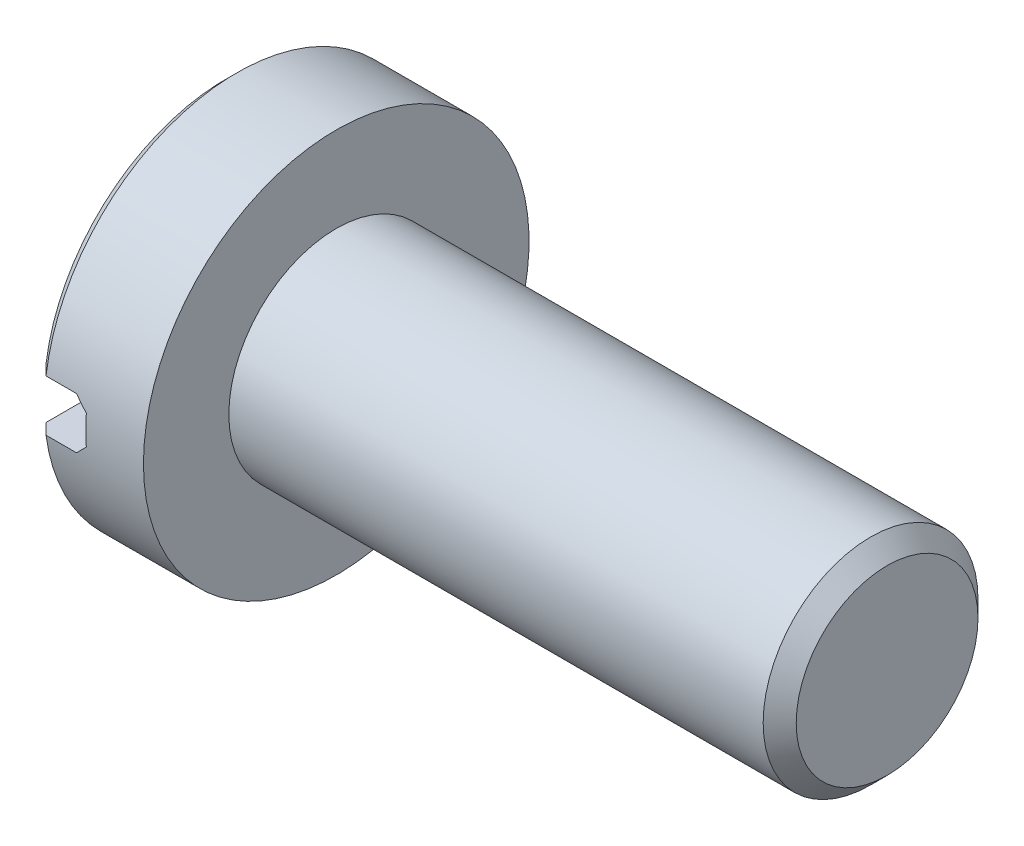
ISO-10303-21;
HEADER;
FILE_DESCRIPTION(('STEP AP214'),'2;1');
FILE_NAME('part.step','',(''),(''),'','','');
FILE_SCHEMA(('AUTOMOTIVE_DESIGN { 1 0 10303 214 1 1 1 1 }'));
ENDSEC;
DATA;
#1=APPLICATION_CONTEXT('core data for automotive mechanical design processes');
#2=APPLICATION_PROTOCOL_DEFINITION('international standard','automotive_design',2000,#1);
#3=PRODUCT_CONTEXT('',#1,'mechanical');
#4=PRODUCT('Part','Part','',(#3));
#5=PRODUCT_RELATED_PRODUCT_CATEGORY('part','',(#4));
#6=PRODUCT_DEFINITION_FORMATION('','',#4);
#7=PRODUCT_DEFINITION_CONTEXT('part definition',#1,'design');
#8=PRODUCT_DEFINITION('design','',#6,#7);
#9=PRODUCT_DEFINITION_SHAPE('','',#8);
#10=(LENGTH_UNIT() NAMED_UNIT(*) SI_UNIT(.MILLI.,.METRE.));
#11=(NAMED_UNIT(*) PLANE_ANGLE_UNIT() SI_UNIT($,.RADIAN.));
#12=(NAMED_UNIT(*) SI_UNIT($,.STERADIAN.) SOLID_ANGLE_UNIT());
#13=UNCERTAINTY_MEASURE_WITH_UNIT(LENGTH_MEASURE(1.E-05),#10,'distance_accuracy_value','');
#14=(GEOMETRIC_REPRESENTATION_CONTEXT(3) GLOBAL_UNCERTAINTY_ASSIGNED_CONTEXT((#13)) GLOBAL_UNIT_ASSIGNED_CONTEXT((#10,
#11,#12)) REPRESENTATION_CONTEXT('',''));
#15=CARTESIAN_POINT('',(0.,0.,0.));
#16=DIRECTION('',(0.,0.,1.));
#17=DIRECTION('',(1.,0.,0.));
#18=AXIS2_PLACEMENT_3D('',#15,#16,#17);
#19=CARTESIAN_POINT('',(0.,0.,0.));
#20=DIRECTION('',(1.,0.,0.));
#21=DIRECTION('',(0.,0.,-1.));
#22=AXIS2_PLACEMENT_3D('',#19,#20,#21);
#23=PLANE('',#22);
#24=CARTESIAN_POINT('',(0.,0.,0.));
#25=DIRECTION('',(-1.,0.,0.));
#26=DIRECTION('',(0.,0.,1.));
#27=AXIS2_PLACEMENT_3D('',#24,#25,#26);
#28=CIRCLE('',#27,3.3);
#29=CARTESIAN_POINT('',(0.,0.465549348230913,3.26699614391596));
#30=VERTEX_POINT('',#29);
#31=CARTESIAN_POINT('',(0.,0.465549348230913,-3.26699614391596));
#32=VERTEX_POINT('',#31);
#33=EDGE_CURVE('E116',#30,#32,#28,.T.);
#34=ORIENTED_EDGE('',*,*,#33,.T.);
#35=DIRECTION('',(0.,0.,1.));
#36=VECTOR('',#35,1.);
#37=CARTESIAN_POINT('',(0.,0.465549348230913,-5.));
#38=LINE('',#37,#36);
#39=EDGE_CURVE('E108',#32,#30,#38,.T.);
#40=ORIENTED_EDGE('',*,*,#39,.T.);
#41=EDGE_LOOP('',(#34,#40));
#42=FACE_BOUND('',#41,.T.);
#43=ADVANCED_FACE('F33',(#42),#23,.F.);
#44=CARTESIAN_POINT('',(0.2,0.,0.));
#45=DIRECTION('',(1.,0.,0.));
#46=DIRECTION('',(0.,0.,-1.));
#47=AXIS2_PLACEMENT_3D('',#44,#45,#46);
#48=CONICAL_SURFACE('',#47,3.5,0.785398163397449);
#49=CARTESIAN_POINT('',(0.2,0.,0.));
#50=DIRECTION('',(-1.,0.,0.));
#51=DIRECTION('',(0.,0.,1.));
#52=AXIS2_PLACEMENT_3D('',#49,#50,#51);
#53=CIRCLE('',#52,3.5);
#54=CARTESIAN_POINT('',(0.2,0.465549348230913,3.46889950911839));
#55=VERTEX_POINT('',#54);
#56=CARTESIAN_POINT('',(0.2,0.465549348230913,-3.46889950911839));
#57=VERTEX_POINT('',#56);
#58=EDGE_CURVE('E117',#55,#57,#53,.T.);
#59=ORIENTED_EDGE('',*,*,#58,.T.);
#60=CARTESIAN_POINT('',(4.40191393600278,0.465549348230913,-7.68783077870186));
#61=CARTESIAN_POINT('',(4.14003731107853,0.465549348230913,-7.42547061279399));
#62=CARTESIAN_POINT('',(3.87818163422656,0.465549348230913,-7.16308952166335));
#63=CARTESIAN_POINT('',(3.35453517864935,0.465549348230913,-6.63825496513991));
#64=CARTESIAN_POINT('',(3.09274440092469,0.465549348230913,-6.37580149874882));
#65=CARTESIAN_POINT('',(2.56917324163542,0.465549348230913,-5.85071392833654));
#66=CARTESIAN_POINT('',(2.30739289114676,0.465549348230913,-5.58807979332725));
#67=CARTESIAN_POINT('',(1.78397993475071,0.465549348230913,-5.0626717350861));
#68=CARTESIAN_POINT('',(1.52234732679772,0.465549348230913,-4.79989781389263));
#69=CARTESIAN_POINT('',(0.99195532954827,0.465549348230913,-4.26672055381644));
#70=CARTESIAN_POINT('',(0.723202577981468,0.465549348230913,-3.99631061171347));
#71=CARTESIAN_POINT('',(0.186112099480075,0.465549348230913,-3.45505585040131));
#72=CARTESIAN_POINT('',(-0.0822256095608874,0.465549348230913,-3.18421101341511));
#73=CARTESIAN_POINT('',(-0.484027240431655,0.465549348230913,-2.77730282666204));
#74=CARTESIAN_POINT('',(-0.617829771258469,0.465549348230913,-2.64157406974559));
#75=CARTESIAN_POINT('',(-0.885074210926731,0.465549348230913,-2.36975739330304));
#76=CARTESIAN_POINT('',(-1.01851611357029,0.465549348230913,-2.23366946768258));
#77=CARTESIAN_POINT('',(-1.28479456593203,0.465549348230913,-1.96092161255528));
#78=CARTESIAN_POINT('',(-1.41763116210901,0.465549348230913,-1.82426172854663));
#79=CARTESIAN_POINT('',(-1.61602415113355,0.465549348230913,-1.61844416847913));
#80=CARTESIAN_POINT('',(-1.68201058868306,0.465549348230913,-1.54970131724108));
#81=CARTESIAN_POINT('',(-1.81355800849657,0.465549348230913,-1.41181004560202));
#82=CARTESIAN_POINT('',(-1.87911899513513,0.465549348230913,-1.34266162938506));
#83=CARTESIAN_POINT('',(-1.97951973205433,0.465549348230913,-1.23575684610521));
#84=CARTESIAN_POINT('',(-2.01459292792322,0.465549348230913,-1.19821983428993));
#85=CARTESIAN_POINT('',(-2.08448824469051,0.465549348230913,-1.12291139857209));
#86=CARTESIAN_POINT('',(-2.11931036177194,0.465549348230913,-1.08513997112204));
#87=CARTESIAN_POINT('',(-2.18853408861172,0.465549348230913,-1.00938438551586));
#88=CARTESIAN_POINT('',(-2.22293652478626,0.465549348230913,-0.971400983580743));
#89=CARTESIAN_POINT('',(-2.2912817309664,0.465549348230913,-0.895023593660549));
#90=CARTESIAN_POINT('',(-2.32522451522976,0.465549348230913,-0.856629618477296));
#91=CARTESIAN_POINT('',(-2.40171511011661,0.465549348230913,-0.768621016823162));
#92=CARTESIAN_POINT('',(-2.44405832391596,0.465549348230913,-0.718828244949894));
#93=CARTESIAN_POINT('',(-2.52717632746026,0.465549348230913,-0.61755940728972));
#94=CARTESIAN_POINT('',(-2.56794360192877,0.465549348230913,-0.566077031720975));
#95=CARTESIAN_POINT('',(-2.6267348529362,0.465549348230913,-0.486684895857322));
#96=CARTESIAN_POINT('',(-2.64602757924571,0.465549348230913,-0.459721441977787));
#97=CARTESIAN_POINT('',(-2.68334610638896,0.465549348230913,-0.404886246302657));
#98=CARTESIAN_POINT('',(-2.70137077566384,0.465549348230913,-0.377013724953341));
#99=CARTESIAN_POINT('',(-2.73539460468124,0.465549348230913,-0.320245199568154));
#100=CARTESIAN_POINT('',(-2.75140438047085,0.465549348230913,-0.291355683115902));
#101=CARTESIAN_POINT('',(-2.78042556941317,0.465549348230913,-0.232134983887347));
#102=CARTESIAN_POINT('',(-2.79344313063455,0.465549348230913,-0.201806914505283));
#103=CARTESIAN_POINT('',(-2.81487197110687,0.465549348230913,-0.139505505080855));
#104=CARTESIAN_POINT('',(-2.82328789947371,0.465549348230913,-0.107533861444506));
#105=CARTESIAN_POINT('',(-2.83357686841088,0.465549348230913,-0.0426642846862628));
#106=CARTESIAN_POINT('',(-2.83548877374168,0.465549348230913,-0.00977304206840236));
#107=CARTESIAN_POINT('',(-2.8322830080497,0.465549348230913,0.0556497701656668));
#108=CARTESIAN_POINT('',(-2.82716197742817,0.465549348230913,0.0881811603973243));
#109=CARTESIAN_POINT('',(-2.81127176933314,0.465549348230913,0.151954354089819));
#110=CARTESIAN_POINT('',(-2.80046518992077,0.465549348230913,0.183186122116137));
#111=CARTESIAN_POINT('',(-2.77169158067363,0.465549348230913,0.252216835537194));
#112=CARTESIAN_POINT('',(-2.75257974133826,0.465549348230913,0.28951762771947));
#113=CARTESIAN_POINT('',(-2.71091087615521,0.465549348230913,0.362179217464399));
#114=CARTESIAN_POINT('',(-2.68834490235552,0.465549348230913,0.397534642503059));
#115=CARTESIAN_POINT('',(-2.64101528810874,0.465549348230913,0.467092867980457));
#116=CARTESIAN_POINT('',(-2.61623709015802,0.465549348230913,0.501285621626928));
#117=CARTESIAN_POINT('',(-2.56542394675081,0.465549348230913,0.56863990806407));
#118=CARTESIAN_POINT('',(-2.53939072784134,0.465549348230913,0.601802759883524));
#119=CARTESIAN_POINT('',(-2.48216715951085,0.465549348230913,0.672773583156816));
#120=CARTESIAN_POINT('',(-2.45082666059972,0.465549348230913,0.710459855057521));
#121=CARTESIAN_POINT('',(-2.38738327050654,0.465549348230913,0.785186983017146));
#122=CARTESIAN_POINT('',(-2.35528030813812,0.465549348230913,0.822227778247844));
#123=CARTESIAN_POINT('',(-2.25817706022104,0.465549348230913,0.932688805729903));
#124=CARTESIAN_POINT('',(-2.19240103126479,0.465549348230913,1.00542526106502));
#125=CARTESIAN_POINT('',(-2.05967494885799,0.465549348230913,1.14998708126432));
#126=CARTESIAN_POINT('',(-1.99272345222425,0.465549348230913,1.22181110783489));
#127=CARTESIAN_POINT('',(-1.8581670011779,0.465549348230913,1.36481961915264));
#128=CARTESIAN_POINT('',(-1.79056216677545,0.465549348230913,1.43600421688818));
#129=CARTESIAN_POINT('',(-1.65536323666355,0.465549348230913,1.57750566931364));
#130=CARTESIAN_POINT('',(-1.58777189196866,0.465549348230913,1.64782515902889));
#131=CARTESIAN_POINT('',(-1.45229526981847,0.465549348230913,1.78818663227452));
#132=CARTESIAN_POINT('',(-1.38440997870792,0.465549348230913,1.85822860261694));
#133=CARTESIAN_POINT('',(-1.18054210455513,0.465549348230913,2.06795858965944));
#134=CARTESIAN_POINT('',(-1.04425331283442,0.465549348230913,2.20734874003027));
#135=CARTESIAN_POINT('',(-0.689169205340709,0.465549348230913,2.56935506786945));
#136=CARTESIAN_POINT('',(-0.470026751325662,0.465549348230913,2.79163016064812));
#137=CARTESIAN_POINT('',(-0.0312004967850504,0.465549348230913,3.23564818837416));
#138=CARTESIAN_POINT('',(0.18848330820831,0.465549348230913,3.45739111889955));
#139=CARTESIAN_POINT('',(0.628225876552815,0.465549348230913,3.90064057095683));
#140=CARTESIAN_POINT('',(0.848284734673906,0.465549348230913,4.12214699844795));
#141=CARTESIAN_POINT('',(1.2885900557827,0.465549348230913,4.56497199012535));
#142=CARTESIAN_POINT('',(1.50883651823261,0.465549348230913,4.78629055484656));
#143=CARTESIAN_POINT('',(2.17434181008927,0.465549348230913,5.45467038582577));
#144=CARTESIAN_POINT('',(2.61978685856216,0.465549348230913,5.90154621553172));
#145=CARTESIAN_POINT('',(3.28806027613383,0.465549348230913,6.57160913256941));
#146=CARTESIAN_POINT('',(3.51079941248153,0.465549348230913,6.79488526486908));
#147=CARTESIAN_POINT('',(3.95632455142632,0.465549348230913,7.24139030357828));
#148=CARTESIAN_POINT('',(4.17911055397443,0.465549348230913,7.4646192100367));
#149=CARTESIAN_POINT('',(4.40191393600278,0.465549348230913,7.68783077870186));
#150=B_SPLINE_CURVE_WITH_KNOTS('',3,(#60,#61,#62,#63,#64,#65,#66,#67,#68,#69,#70,#71,#72,#73,
#74,#75,#76,#77,#78,#79,#80,#81,#82,#83,#84,#85,#86,#87,#88,#89,#90,#91,#92,#93,#94,#95,#96,#97,
#98,#99,#100,#101,#102,#103,#104,#105,#106,#107,#108,#109,#110,#111,#112,#113,#114,#115,#116,
#117,#118,#119,#120,#121,#122,#123,#124,#125,#126,#127,#128,#129,#130,#131,#132,#133,#134,#135,
#136,#137,#138,#139,#140,#141,#142,#143,#144,#145,#146,#147,#148,#149),.UNSPECIFIED.,.F.,.F.,(4,
2,2,2,2,2,2,2,2,2,2,2,2,2,2,2,2,2,2,2,2,2,2,2,2,2,2,2,2,2,2,2,2,2,2,2,2,2,2,2,2,2,2,2,4),(0.,
1.11207465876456,2.22416551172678,3.33661807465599,4.44905483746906,5.5927968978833,
6.73658696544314,7.30836326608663,7.88014933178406,8.45189074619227,8.73775353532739,
9.02361338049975,9.17773071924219,9.33185039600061,9.4855892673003,9.63932335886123,
9.83539620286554,10.0323109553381,10.1317508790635,10.2312784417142,10.3302574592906,
10.4290312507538,10.5277050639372,10.6257882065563,10.7239182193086,10.8227019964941,
10.9481045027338,11.0738375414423,11.2004694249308,11.3269318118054,11.4739613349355,
11.6210046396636,11.9151786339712,12.2097433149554,12.5042548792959,12.7968641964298,
13.0894872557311,13.6743254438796,14.6107350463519,15.5471524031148,16.4838586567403,
17.4205622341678,19.3134628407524,20.2596047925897,21.2057457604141),.UNSPECIFIED.);
#151=EDGE_CURVE('E56',#57,#32,#150,.T.);
#152=ORIENTED_EDGE('',*,*,#151,.T.);
#153=ORIENTED_EDGE('',*,*,#33,.F.);
#154=EDGE_CURVE('E188',#30,#55,#150,.T.);
#155=ORIENTED_EDGE('',*,*,#154,.T.);
#156=EDGE_LOOP('',(#59,#152,#153,#155));
#157=FACE_BOUND('',#156,.T.);
#158=ADVANCED_FACE('F162',(#157),#48,.T.);
#159=CARTESIAN_POINT('',(0.,-0.465549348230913,-3.26699614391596));
#160=VERTEX_POINT('',#159);
#161=CARTESIAN_POINT('',(0.,-0.465549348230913,3.26699614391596));
#162=VERTEX_POINT('',#161);
#163=EDGE_CURVE('E113',#160,#162,#28,.T.);
#164=ORIENTED_EDGE('',*,*,#163,.T.);
#165=DIRECTION('',(0.,0.,1.));
#166=VECTOR('',#165,1.);
#167=CARTESIAN_POINT('',(0.,-0.465549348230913,-5.));
#168=LINE('',#167,#166);
#169=EDGE_CURVE('E99',#160,#162,#168,.T.);
#170=ORIENTED_EDGE('',*,*,#169,.F.);
#171=EDGE_LOOP('',(#164,#170));
#172=FACE_BOUND('',#171,.T.);
#173=ADVANCED_FACE('F112',(#172),#23,.F.);
#174=CARTESIAN_POINT('',(0.2,-0.465549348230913,-3.46889950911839));
#175=VERTEX_POINT('',#174);
#176=CARTESIAN_POINT('',(0.2,-0.465549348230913,3.46889950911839));
#177=VERTEX_POINT('',#176);
#178=EDGE_CURVE('E121',#175,#177,#53,.T.);
#179=ORIENTED_EDGE('',*,*,#178,.T.);
#180=CARTESIAN_POINT('',(4.40191393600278,-0.465549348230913,7.68783077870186));
#181=CARTESIAN_POINT('',(4.14003731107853,-0.465549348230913,7.42547061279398));
#182=CARTESIAN_POINT('',(3.87818163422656,-0.465549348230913,7.16308952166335));
#183=CARTESIAN_POINT('',(3.35453517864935,-0.465549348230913,6.63825496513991));
#184=CARTESIAN_POINT('',(3.09274440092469,-0.465549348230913,6.37580149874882));
#185=CARTESIAN_POINT('',(2.56917324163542,-0.465549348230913,5.85071392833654));
#186=CARTESIAN_POINT('',(2.30739289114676,-0.465549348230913,5.58807979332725));
#187=CARTESIAN_POINT('',(1.78397993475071,-0.465549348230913,5.0626717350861));
#188=CARTESIAN_POINT('',(1.52234732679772,-0.465549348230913,4.79989781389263));
#189=CARTESIAN_POINT('',(0.99195532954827,-0.465549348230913,4.26672055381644));
#190=CARTESIAN_POINT('',(0.723202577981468,-0.465549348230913,3.99631061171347));
#191=CARTESIAN_POINT('',(0.186112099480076,-0.465549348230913,3.45505585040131));
#192=CARTESIAN_POINT('',(-0.0822256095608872,-0.465549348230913,3.18421101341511));
#193=CARTESIAN_POINT('',(-0.484027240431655,-0.465549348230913,2.77730282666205));
#194=CARTESIAN_POINT('',(-0.617829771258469,-0.465549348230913,2.64157406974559));
#195=CARTESIAN_POINT('',(-0.885074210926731,-0.465549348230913,2.36975739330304));
#196=CARTESIAN_POINT('',(-1.01851611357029,-0.465549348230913,2.23366946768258));
#197=CARTESIAN_POINT('',(-1.28479456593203,-0.465549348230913,1.96092161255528));
#198=CARTESIAN_POINT('',(-1.41763116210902,-0.465549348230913,1.82426172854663));
#199=CARTESIAN_POINT('',(-1.61602415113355,-0.465549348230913,1.61844416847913));
#200=CARTESIAN_POINT('',(-1.68201058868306,-0.465549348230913,1.54970131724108));
#201=CARTESIAN_POINT('',(-1.81355800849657,-0.465549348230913,1.41181004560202));
#202=CARTESIAN_POINT('',(-1.87911899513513,-0.465549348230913,1.34266162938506));
#203=CARTESIAN_POINT('',(-1.97951973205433,-0.465549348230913,1.23575684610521));
#204=CARTESIAN_POINT('',(-2.01459292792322,-0.465549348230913,1.19821983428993));
#205=CARTESIAN_POINT('',(-2.08448824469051,-0.465549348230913,1.12291139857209));
#206=CARTESIAN_POINT('',(-2.11931036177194,-0.465549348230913,1.08513997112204));
#207=CARTESIAN_POINT('',(-2.18853408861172,-0.465549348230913,1.00938438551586));
#208=CARTESIAN_POINT('',(-2.22293652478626,-0.465549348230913,0.971400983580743));
#209=CARTESIAN_POINT('',(-2.2912817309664,-0.465549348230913,0.895023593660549));
#210=CARTESIAN_POINT('',(-2.32522451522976,-0.465549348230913,0.856629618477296));
#211=CARTESIAN_POINT('',(-2.40171511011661,-0.465549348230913,0.768621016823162));
#212=CARTESIAN_POINT('',(-2.44405832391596,-0.465549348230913,0.718828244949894));
#213=CARTESIAN_POINT('',(-2.52717632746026,-0.465549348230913,0.61755940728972));
#214=CARTESIAN_POINT('',(-2.56794360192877,-0.465549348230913,0.566077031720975));
#215=CARTESIAN_POINT('',(-2.6267348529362,-0.465549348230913,0.486684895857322));
#216=CARTESIAN_POINT('',(-2.64602757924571,-0.465549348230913,0.459721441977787));
#217=CARTESIAN_POINT('',(-2.68334610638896,-0.465549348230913,0.404886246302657));
#218=CARTESIAN_POINT('',(-2.70137077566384,-0.465549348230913,0.377013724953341));
#219=CARTESIAN_POINT('',(-2.73539460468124,-0.465549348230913,0.320245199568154));
#220=CARTESIAN_POINT('',(-2.75140438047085,-0.465549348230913,0.291355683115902));
#221=CARTESIAN_POINT('',(-2.78042556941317,-0.465549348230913,0.232134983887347));
#222=CARTESIAN_POINT('',(-2.79344313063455,-0.465549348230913,0.201806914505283));
#223=CARTESIAN_POINT('',(-2.81487197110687,-0.465549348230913,0.139505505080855));
#224=CARTESIAN_POINT('',(-2.82328789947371,-0.465549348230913,0.107533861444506));
#225=CARTESIAN_POINT('',(-2.83357686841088,-0.465549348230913,0.0426642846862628));
#226=CARTESIAN_POINT('',(-2.83548877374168,-0.465549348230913,0.00977304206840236));
#227=CARTESIAN_POINT('',(-2.8322830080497,-0.465549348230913,-0.0556497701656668));
#228=CARTESIAN_POINT('',(-2.82716197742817,-0.465549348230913,-0.0881811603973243));
#229=CARTESIAN_POINT('',(-2.81127176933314,-0.465549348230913,-0.151954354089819));
#230=CARTESIAN_POINT('',(-2.80046518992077,-0.465549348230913,-0.183186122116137));
#231=CARTESIAN_POINT('',(-2.77169158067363,-0.465549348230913,-0.252216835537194));
#232=CARTESIAN_POINT('',(-2.75257974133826,-0.465549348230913,-0.28951762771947));
#233=CARTESIAN_POINT('',(-2.71091087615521,-0.465549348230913,-0.362179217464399));
#234=CARTESIAN_POINT('',(-2.68834490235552,-0.465549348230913,-0.397534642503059));
#235=CARTESIAN_POINT('',(-2.64101528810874,-0.465549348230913,-0.467092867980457));
#236=CARTESIAN_POINT('',(-2.61623709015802,-0.465549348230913,-0.501285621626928));
#237=CARTESIAN_POINT('',(-2.56542394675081,-0.465549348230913,-0.56863990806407));
#238=CARTESIAN_POINT('',(-2.53939072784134,-0.465549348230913,-0.601802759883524));
#239=CARTESIAN_POINT('',(-2.48216715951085,-0.465549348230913,-0.672773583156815));
#240=CARTESIAN_POINT('',(-2.45082666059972,-0.465549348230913,-0.71045985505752));
#241=CARTESIAN_POINT('',(-2.38738327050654,-0.465549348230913,-0.785186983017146));
#242=CARTESIAN_POINT('',(-2.35528030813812,-0.465549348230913,-0.822227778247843));
#243=CARTESIAN_POINT('',(-2.25817706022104,-0.465549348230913,-0.932688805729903));
#244=CARTESIAN_POINT('',(-2.19240103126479,-0.465549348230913,-1.00542526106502));
#245=CARTESIAN_POINT('',(-2.05967494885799,-0.465549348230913,-1.14998708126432));
#246=CARTESIAN_POINT('',(-1.99272345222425,-0.465549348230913,-1.22181110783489));
#247=CARTESIAN_POINT('',(-1.8581670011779,-0.465549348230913,-1.36481961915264));
#248=CARTESIAN_POINT('',(-1.79056216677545,-0.465549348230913,-1.43600421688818));
#249=CARTESIAN_POINT('',(-1.65536323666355,-0.465549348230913,-1.57750566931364));
#250=CARTESIAN_POINT('',(-1.58777189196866,-0.465549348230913,-1.64782515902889));
#251=CARTESIAN_POINT('',(-1.45229526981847,-0.465549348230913,-1.78818663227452));
#252=CARTESIAN_POINT('',(-1.38440997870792,-0.465549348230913,-1.85822860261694));
#253=CARTESIAN_POINT('',(-1.18054210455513,-0.465549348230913,-2.06795858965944));
#254=CARTESIAN_POINT('',(-1.04425331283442,-0.465549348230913,-2.20734874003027));
#255=CARTESIAN_POINT('',(-0.689169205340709,-0.465549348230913,-2.56935506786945));
#256=CARTESIAN_POINT('',(-0.470026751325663,-0.465549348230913,-2.79163016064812));
#257=CARTESIAN_POINT('',(-0.0312004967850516,-0.465549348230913,-3.23564818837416));
#258=CARTESIAN_POINT('',(0.188483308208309,-0.465549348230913,-3.45739111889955));
#259=CARTESIAN_POINT('',(0.628225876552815,-0.465549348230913,-3.90064057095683));
#260=CARTESIAN_POINT('',(0.848284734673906,-0.465549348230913,-4.12214699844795));
#261=CARTESIAN_POINT('',(1.2885900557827,-0.465549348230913,-4.56497199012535));
#262=CARTESIAN_POINT('',(1.50883651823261,-0.465549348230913,-4.78629055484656));
#263=CARTESIAN_POINT('',(2.17434181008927,-0.465549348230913,-5.45467038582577));
#264=CARTESIAN_POINT('',(2.61978685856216,-0.465549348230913,-5.90154621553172));
#265=CARTESIAN_POINT('',(3.28806027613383,-0.465549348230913,-6.57160913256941));
#266=CARTESIAN_POINT('',(3.51079941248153,-0.465549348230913,-6.79488526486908));
#267=CARTESIAN_POINT('',(3.95632455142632,-0.465549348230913,-7.24139030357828));
#268=CARTESIAN_POINT('',(4.17911055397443,-0.465549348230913,-7.4646192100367));
#269=CARTESIAN_POINT('',(4.40191393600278,-0.465549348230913,-7.68783077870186));
#270=B_SPLINE_CURVE_WITH_KNOTS('',3,(#180,#181,#182,#183,#184,#185,#186,#187,#188,#189,#190,
#191,#192,#193,#194,#195,#196,#197,#198,#199,#200,#201,#202,#203,#204,#205,#206,#207,#208,#209,
#210,#211,#212,#213,#214,#215,#216,#217,#218,#219,#220,#221,#222,#223,#224,#225,#226,#227,#228,
#229,#230,#231,#232,#233,#234,#235,#236,#237,#238,#239,#240,#241,#242,#243,#244,#245,#246,#247,
#248,#249,#250,#251,#252,#253,#254,#255,#256,#257,#258,#259,#260,#261,#262,#263,#264,#265,#266,
#267,#268,#269),.UNSPECIFIED.,.F.,.F.,(4,2,2,2,2,2,2,2,2,2,2,2,2,2,2,2,2,2,2,2,2,2,2,2,2,2,2,2,
2,2,2,2,2,2,2,2,2,2,2,2,2,2,2,2,4),(0.,1.11207465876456,2.22416551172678,3.33661807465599,
4.44905483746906,5.5927968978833,6.73658696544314,7.30836326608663,7.88014933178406,
8.45189074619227,8.73775353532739,9.02361338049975,9.17773071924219,9.33185039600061,
9.48558926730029,9.63932335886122,9.83539620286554,10.0323109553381,10.1317508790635,
10.2312784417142,10.3302574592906,10.4290312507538,10.5277050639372,10.6257882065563,
10.7239182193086,10.8227019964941,10.9481045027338,11.0738375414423,11.2004694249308,
11.3269318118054,11.4739613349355,11.6210046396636,11.9151786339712,12.2097433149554,
12.5042548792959,12.7968641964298,13.0894872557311,13.6743254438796,14.6107350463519,
15.5471524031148,16.4838586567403,17.4205622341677,19.3134628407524,20.2596047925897,
21.2057457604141),.UNSPECIFIED.);
#271=EDGE_CURVE('E107',#177,#162,#270,.T.);
#272=ORIENTED_EDGE('',*,*,#271,.T.);
#273=ORIENTED_EDGE('',*,*,#163,.F.);
#274=EDGE_CURVE('E96',#160,#175,#270,.T.);
#275=ORIENTED_EDGE('',*,*,#274,.T.);
#276=EDGE_LOOP('',(#179,#272,#273,#275));
#277=FACE_BOUND('',#276,.T.);
#278=ADVANCED_FACE('F115',(#277),#48,.T.);
#279=CARTESIAN_POINT('',(0.,0.,0.));
#280=DIRECTION('',(-1.,0.,0.));
#281=DIRECTION('',(0.,0.,1.));
#282=AXIS2_PLACEMENT_3D('',#279,#280,#281);
#283=CYLINDRICAL_SURFACE('',#282,3.5);
#284=ORIENTED_EDGE('',*,*,#58,.F.);
#285=DIRECTION('',(-1.,0.,0.));
#286=VECTOR('',#285,1.);
#287=CARTESIAN_POINT('',(0.,0.465549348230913,3.46889950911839));
#288=LINE('',#287,#286);
#289=CARTESIAN_POINT('',(0.753445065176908,0.465549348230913,3.46889950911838));
#290=VERTEX_POINT('',#289);
#291=EDGE_CURVE('E143',#55,#290,#288,.F.);
#292=ORIENTED_EDGE('',*,*,#291,.T.);
#293=CARTESIAN_POINT('',(1.21899441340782,0.,0.));
#294=DIRECTION('',(0.707106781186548,0.707106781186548,0.));
#295=DIRECTION('',(-0.707106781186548,0.707106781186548,0.));
#296=AXIS2_PLACEMENT_3D('',#293,#294,#295);
#297=ELLIPSE('',#296,4.94974746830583,3.5);
#298=CARTESIAN_POINT('',(0.953445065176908,0.265549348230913,3.48991168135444));
#299=VERTEX_POINT('',#298);
#300=EDGE_CURVE('E138',#290,#299,#297,.T.);
#301=ORIENTED_EDGE('',*,*,#300,.T.);
#302=CARTESIAN_POINT('',(0.953445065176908,0.,0.));
#303=DIRECTION('',(1.,0.,0.));
#304=DIRECTION('',(0.,0.,-1.));
#305=AXIS2_PLACEMENT_3D('',#302,#303,#304);
#306=CIRCLE('',#305,3.5);
#307=CARTESIAN_POINT('',(0.953445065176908,-0.265549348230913,3.48991168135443));
#308=VERTEX_POINT('',#307);
#309=EDGE_CURVE('E134',#299,#308,#306,.T.);
#310=ORIENTED_EDGE('',*,*,#309,.T.);
#311=CARTESIAN_POINT('',(1.21899441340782,0.,0.));
#312=DIRECTION('',(0.707106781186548,-0.707106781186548,0.));
#313=DIRECTION('',(-0.707106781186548,-0.707106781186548,0.));
#314=AXIS2_PLACEMENT_3D('',#311,#312,#313);
#315=ELLIPSE('',#314,4.94974746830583,3.5);
#316=CARTESIAN_POINT('',(0.753445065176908,-0.465549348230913,3.46889950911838));
#317=VERTEX_POINT('',#316);
#318=EDGE_CURVE('E130',#308,#317,#315,.T.);
#319=ORIENTED_EDGE('',*,*,#318,.T.);
#320=DIRECTION('',(-1.,0.,0.));
#321=VECTOR('',#320,1.);
#322=CARTESIAN_POINT('',(0.,-0.465549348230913,3.46889950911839));
#323=LINE('',#322,#321);
#324=EDGE_CURVE('E140',#317,#177,#323,.T.);
#325=ORIENTED_EDGE('',*,*,#324,.T.);
#326=ORIENTED_EDGE('',*,*,#178,.F.);
#327=DIRECTION('',(-1.,0.,0.));
#328=VECTOR('',#327,1.);
#329=CARTESIAN_POINT('',(0.,-0.465549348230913,-3.46889950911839));
#330=LINE('',#329,#328);
#331=CARTESIAN_POINT('',(0.753445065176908,-0.465549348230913,-3.46889950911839));
#332=VERTEX_POINT('',#331);
#333=EDGE_CURVE('E102',#175,#332,#330,.F.);
#334=ORIENTED_EDGE('',*,*,#333,.T.);
#335=CARTESIAN_POINT('',(0.953445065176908,-0.265549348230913,-3.48991168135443));
#336=VERTEX_POINT('',#335);
#337=EDGE_CURVE('E126',#332,#336,#315,.T.);
#338=ORIENTED_EDGE('',*,*,#337,.T.);
#339=CARTESIAN_POINT('',(0.953445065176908,0.265549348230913,-3.48991168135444));
#340=VERTEX_POINT('',#339);
#341=EDGE_CURVE('E129',#336,#340,#306,.T.);
#342=ORIENTED_EDGE('',*,*,#341,.T.);
#343=CARTESIAN_POINT('',(0.753445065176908,0.465549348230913,-3.46889950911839));
#344=VERTEX_POINT('',#343);
#345=EDGE_CURVE('E133',#340,#344,#297,.T.);
#346=ORIENTED_EDGE('',*,*,#345,.T.);
#347=DIRECTION('',(-1.,0.,0.));
#348=VECTOR('',#347,1.);
#349=CARTESIAN_POINT('',(0.,0.465549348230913,-3.46889950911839));
#350=LINE('',#349,#348);
#351=EDGE_CURVE('E137',#344,#57,#350,.T.);
#352=ORIENTED_EDGE('',*,*,#351,.T.);
#353=EDGE_LOOP('',(#284,#292,#301,#310,#319,#325,#326,#334,#338,#342,#346,#352));
#354=FACE_BOUND('',#353,.T.);
#355=CARTESIAN_POINT('',(2.,0.,0.));
#356=DIRECTION('',(-1.,0.,0.));
#357=DIRECTION('',(0.,0.,1.));
#358=AXIS2_PLACEMENT_3D('',#355,#356,#357);
#359=CIRCLE('',#358,3.5);
#360=CARTESIAN_POINT('',(2.,0.,3.5));
#361=VERTEX_POINT('',#360);
#362=EDGE_CURVE('E194',#361,#361,#359,.T.);
#363=ORIENTED_EDGE('',*,*,#362,.T.);
#364=EDGE_LOOP('',(#363));
#365=FACE_BOUND('',#364,.T.);
#366=ADVANCED_FACE('F173',(#354,#365),#283,.T.);
#367=CARTESIAN_POINT('',(2.,3.5,0.));
#368=DIRECTION('',(-1.,0.,0.));
#369=DIRECTION('',(0.,0.,1.));
#370=AXIS2_PLACEMENT_3D('',#367,#368,#369);
#371=PLANE('',#370);
#372=CARTESIAN_POINT('',(2.,0.,0.));
#373=DIRECTION('',(-1.,0.,0.));
#374=DIRECTION('',(0.,0.,1.));
#375=AXIS2_PLACEMENT_3D('',#372,#373,#374);
#376=CIRCLE('',#375,1.95);
#377=CARTESIAN_POINT('',(2.,0.,1.95));
#378=VERTEX_POINT('',#377);
#379=EDGE_CURVE('E146',#378,#378,#376,.F.);
#380=ORIENTED_EDGE('',*,*,#379,.F.);
#381=EDGE_LOOP('',(#380));
#382=FACE_BOUND('',#381,.T.);
#383=ORIENTED_EDGE('',*,*,#362,.F.);
#384=EDGE_LOOP('',(#383));
#385=FACE_BOUND('',#384,.T.);
#386=ADVANCED_FACE('F177',(#382,#385),#371,.F.);
#387=CARTESIAN_POINT('',(0.,0.465549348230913,-5.));
#388=DIRECTION('',(0.,1.,0.));
#389=DIRECTION('',(0.,0.,1.));
#390=AXIS2_PLACEMENT_3D('',#387,#388,#389);
#391=PLANE('',#390);
#392=ORIENTED_EDGE('',*,*,#351,.F.);
#393=DIRECTION('',(0.,0.,1.));
#394=VECTOR('',#393,1.);
#395=CARTESIAN_POINT('',(0.753445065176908,0.465549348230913,-5.));
#396=LINE('',#395,#394);
#397=EDGE_CURVE('E225',#344,#290,#396,.T.);
#398=ORIENTED_EDGE('',*,*,#397,.T.);
#399=ORIENTED_EDGE('',*,*,#291,.F.);
#400=ORIENTED_EDGE('',*,*,#154,.F.);
#401=ORIENTED_EDGE('',*,*,#39,.F.);
#402=ORIENTED_EDGE('',*,*,#151,.F.);
#403=EDGE_LOOP('',(#392,#398,#399,#400,#401,#402));
#404=FACE_BOUND('',#403,.T.);
#405=ADVANCED_FACE('F195',(#404),#391,.F.);
#406=CARTESIAN_POINT('',(0.753445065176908,0.465549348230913,-5.));
#407=DIRECTION('',(0.707106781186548,0.707106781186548,0.));
#408=DIRECTION('',(-0.707106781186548,0.707106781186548,0.));
#409=AXIS2_PLACEMENT_3D('',#406,#407,#408);
#410=PLANE('',#409);
#411=ORIENTED_EDGE('',*,*,#397,.F.);
#412=ORIENTED_EDGE('',*,*,#345,.F.);
#413=DIRECTION('',(0.,0.,1.));
#414=VECTOR('',#413,1.);
#415=CARTESIAN_POINT('',(0.953445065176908,0.265549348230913,-5.));
#416=LINE('',#415,#414);
#417=EDGE_CURVE('E228',#340,#299,#416,.T.);
#418=ORIENTED_EDGE('',*,*,#417,.T.);
#419=ORIENTED_EDGE('',*,*,#300,.F.);
#420=EDGE_LOOP('',(#411,#412,#418,#419));
#421=FACE_BOUND('',#420,.T.);
#422=ADVANCED_FACE('F200',(#421),#410,.F.);
#423=CARTESIAN_POINT('',(0.953445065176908,0.265549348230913,-5.));
#424=DIRECTION('',(1.,0.,0.));
#425=DIRECTION('',(0.,0.,-1.));
#426=AXIS2_PLACEMENT_3D('',#423,#424,#425);
#427=PLANE('',#426);
#428=ORIENTED_EDGE('',*,*,#417,.F.);
#429=ORIENTED_EDGE('',*,*,#341,.F.);
#430=DIRECTION('',(0.,0.,1.));
#431=VECTOR('',#430,1.);
#432=CARTESIAN_POINT('',(0.953445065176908,-0.265549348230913,-5.));
#433=LINE('',#432,#431);
#434=EDGE_CURVE('E233',#336,#308,#433,.T.);
#435=ORIENTED_EDGE('',*,*,#434,.T.);
#436=ORIENTED_EDGE('',*,*,#309,.F.);
#437=EDGE_LOOP('',(#428,#429,#435,#436));
#438=FACE_BOUND('',#437,.T.);
#439=ADVANCED_FACE('F203',(#438),#427,.F.);
#440=CARTESIAN_POINT('',(0.753445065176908,-0.465549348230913,-5.));
#441=DIRECTION('',(0.707106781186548,-0.707106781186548,0.));
#442=DIRECTION('',(0.707106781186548,0.707106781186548,0.));
#443=AXIS2_PLACEMENT_3D('',#440,#441,#442);
#444=PLANE('',#443);
#445=DIRECTION('',(0.,0.,1.));
#446=VECTOR('',#445,1.);
#447=CARTESIAN_POINT('',(0.753445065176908,-0.465549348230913,-5.));
#448=LINE('',#447,#446);
#449=EDGE_CURVE('E48',#332,#317,#448,.T.);
#450=ORIENTED_EDGE('',*,*,#449,.T.);
#451=ORIENTED_EDGE('',*,*,#318,.F.);
#452=ORIENTED_EDGE('',*,*,#434,.F.);
#453=ORIENTED_EDGE('',*,*,#337,.F.);
#454=EDGE_LOOP('',(#450,#451,#452,#453));
#455=FACE_BOUND('',#454,.T.);
#456=ADVANCED_FACE('F207',(#455),#444,.F.);
#457=CARTESIAN_POINT('',(0.,-0.465549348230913,-5.));
#458=DIRECTION('',(0.,-1.,0.));
#459=DIRECTION('',(0.,0.,-1.));
#460=AXIS2_PLACEMENT_3D('',#457,#458,#459);
#461=PLANE('',#460);
#462=ORIENTED_EDGE('',*,*,#324,.F.);
#463=ORIENTED_EDGE('',*,*,#449,.F.);
#464=ORIENTED_EDGE('',*,*,#333,.F.);
#465=ORIENTED_EDGE('',*,*,#274,.F.);
#466=ORIENTED_EDGE('',*,*,#169,.T.);
#467=ORIENTED_EDGE('',*,*,#271,.F.);
#468=EDGE_LOOP('',(#462,#463,#464,#465,#466,#467));
#469=FACE_BOUND('',#468,.T.);
#470=ADVANCED_FACE('F98',(#469),#461,.F.);
#471=CARTESIAN_POINT('',(12.,0.,0.));
#472=DIRECTION('',(-1.,0.,0.));
#473=DIRECTION('',(0.,0.,1.));
#474=AXIS2_PLACEMENT_3D('',#471,#472,#473);
#475=CYLINDRICAL_SURFACE('',#474,1.95);
#476=CARTESIAN_POINT('',(11.7,0.,0.));
#477=DIRECTION('',(1.,0.,0.));
#478=DIRECTION('',(0.,0.,-1.));
#479=AXIS2_PLACEMENT_3D('',#476,#477,#478);
#480=CIRCLE('',#479,1.95);
#481=CARTESIAN_POINT('',(11.7,0.,-1.95));
#482=VERTEX_POINT('',#481);
#483=EDGE_CURVE('E11',#482,#482,#480,.F.);
#484=ORIENTED_EDGE('',*,*,#483,.T.);
#485=EDGE_LOOP('',(#484));
#486=FACE_BOUND('',#485,.T.);
#487=ORIENTED_EDGE('',*,*,#379,.T.);
#488=EDGE_LOOP('',(#487));
#489=FACE_BOUND('',#488,.T.);
#490=ADVANCED_FACE('F158',(#486,#489),#475,.T.);
#491=CARTESIAN_POINT('',(12.,0.,0.));
#492=DIRECTION('',(1.,0.,0.));
#493=DIRECTION('',(0.,0.,-1.));
#494=AXIS2_PLACEMENT_3D('',#491,#492,#493);
#495=PLANE('',#494);
#496=CARTESIAN_POINT('',(12.,0.,0.));
#497=DIRECTION('',(1.,0.,0.));
#498=DIRECTION('',(0.,0.,-1.));
#499=AXIS2_PLACEMENT_3D('',#496,#497,#498);
#500=CIRCLE('',#499,1.65);
#501=CARTESIAN_POINT('',(12.,0.,-1.65));
#502=VERTEX_POINT('',#501);
#503=EDGE_CURVE('E41',#502,#502,#500,.T.);
#504=ORIENTED_EDGE('',*,*,#503,.T.);
#505=EDGE_LOOP('',(#504));
#506=FACE_BOUND('',#505,.T.);
#507=ADVANCED_FACE('F151',(#506),#495,.T.);
#508=CARTESIAN_POINT('',(12.,0.,0.));
#509=DIRECTION('',(-1.,0.,0.));
#510=DIRECTION('',(0.,0.,1.));
#511=AXIS2_PLACEMENT_3D('',#508,#509,#510);
#512=CONICAL_SURFACE('',#511,1.65,0.785398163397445);
#513=ORIENTED_EDGE('',*,*,#483,.F.);
#514=EDGE_LOOP('',(#513));
#515=FACE_BOUND('',#514,.T.);
#516=ORIENTED_EDGE('',*,*,#503,.F.);
#517=EDGE_LOOP('',(#516));
#518=FACE_BOUND('',#517,.T.);
#519=ADVANCED_FACE('F35',(#515,#518),#512,.T.);
#520=CLOSED_SHELL('',(#43,#158,#173,#278,#366,#386,#405,#422,#439,#456,#470,#490,#507,#519));
#521=MANIFOLD_SOLID_BREP('B2',#520);
#522=ADVANCED_BREP_SHAPE_REPRESENTATION('',(#18,#521),#14);
#523=SHAPE_DEFINITION_REPRESENTATION(#9,#522);
ENDSEC;
END-ISO-10303-21;
